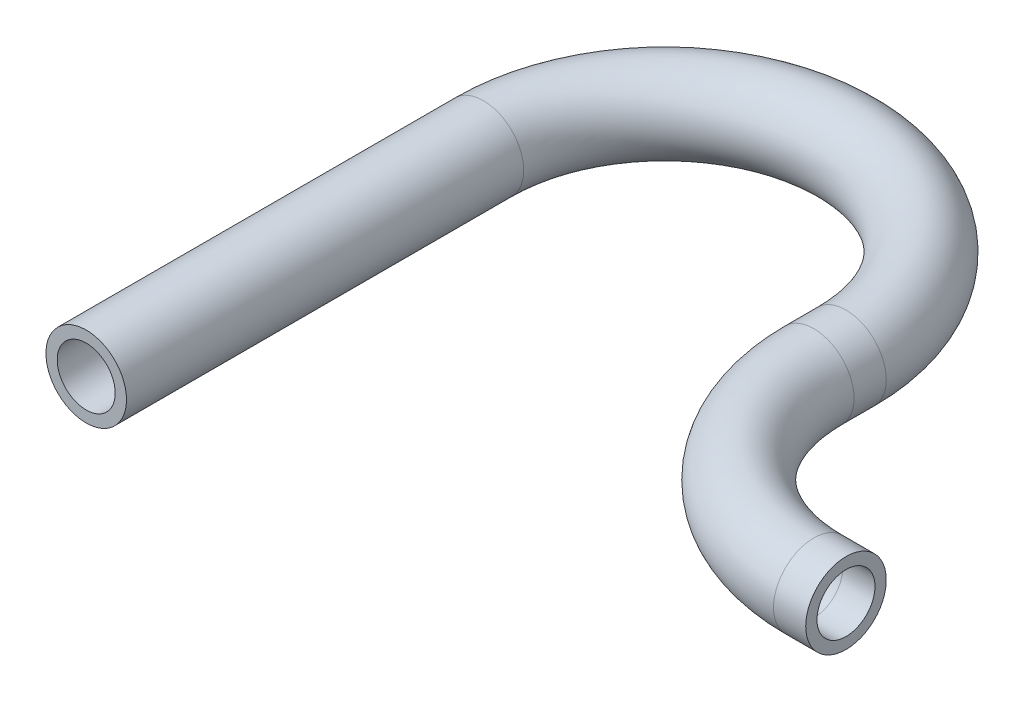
from build123d import *

# Parameters (mm, degrees)
SKETCH2_R   = 3.175
SKETCH2_R_2 = 2.286


with BuildPart() as part:
    # Sweep1: sweep along a path in Sketch1
    with BuildLine(Plane(origin=(0, 0, 0), x_dir=(1, 0, 0), z_dir=(0, 1, 0))) as sweep1_path:
        Line((0, 0), (0, 31.3055))
        ThreePointArc((0, 31.3055), (14.2875, 45.593), (28.575, 31.3055))
        Line((28.575, 31.3055), (28.575, 28.7655))
        ThreePointArc((28.575, 28.7655), (32.759711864, 18.662711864), (42.8625, 14.478))
        Line((42.8625, 14.478), (45.4025, 14.478))
    # Sketch2 → Sweep1 (sweep)
    with BuildSketch(Plane.XY):
        Circle(SKETCH2_R)
        Circle(SKETCH2_R_2, mode=Mode.SUBTRACT)
    sweep(path=sweep1_path.line)


solid = part.part
